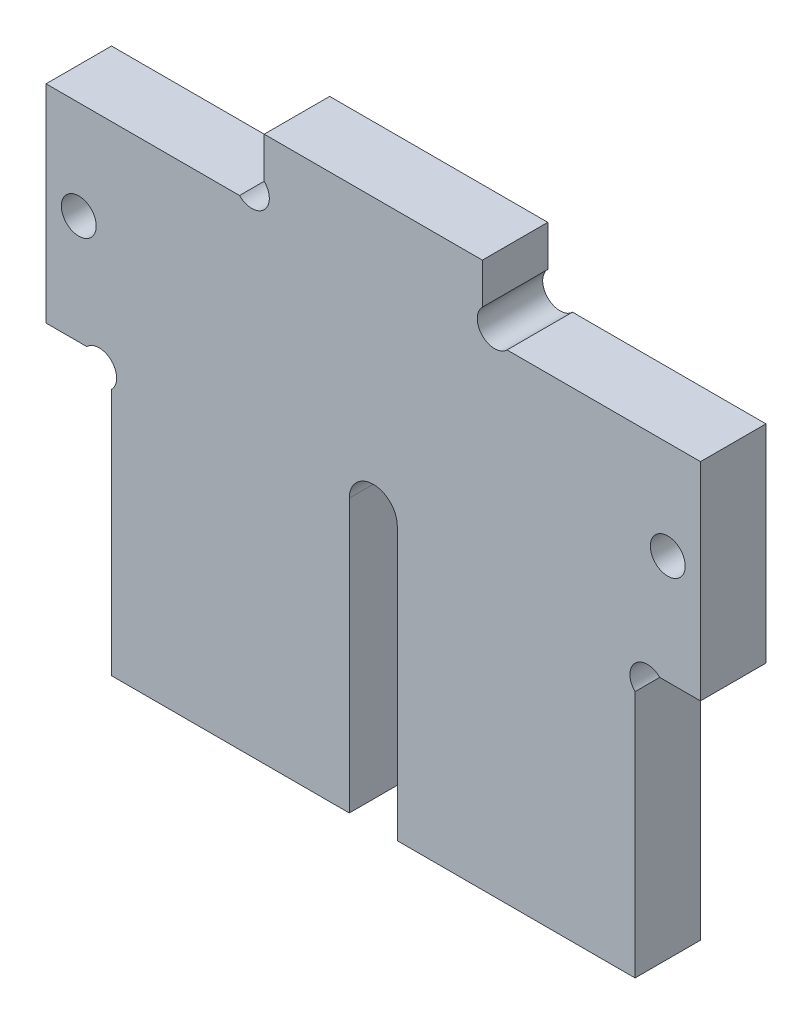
from build123d import *

# Parameters (mm, degrees)
ESQUISSE1_R        = 1.6
BOSS_EXTRU_1_DEPTH = 6


with BuildPart() as part:
    # Esquisse1 → Boss.-Extru.1 (new body)
    with BuildSketch(Plane.XY):
        with BuildLine():
            Line((10, 46.2627417), (10, 50))
            Line((10, 50), (-10, 50))
            Line((-10, 50), (-10, 46.2627417))
            ThreePointArc((-10, 46.2627417), (-10, 44), (-12.2627417, 44))
            Line((-12.2627417, 44), (-30, 44))
            Line((-30, 44), (-30, 25))
            Line((-30, 25), (-26.2627417, 25))
            ThreePointArc((-26.2627417, 25), (-24, 25), (-24, 22.7372583))
            Line((-24, 22.7372583), (-24, 0))
            Line((-24, 0), (-2.2, 0))
            Line((-2.2, 0), (-2.2, 25))
            ThreePointArc((-2.2, 25), (0, 27.2), (2.2, 25))
            Line((2.2, 25), (2.2, 0))
            Line((2.2, 0), (24, 0))
            Line((24, 0), (24, 22.7372583))
            ThreePointArc((24, 22.7372583), (24, 25), (26.2627417, 25))
            Line((26.2627417, 25), (30, 25))
            Line((30, 25), (30, 44))
            Line((30, 44), (12.2627417, 44))
            ThreePointArc((12.2627417, 44), (10, 44), (10, 46.2627417))
        make_face()
        with Locations((27, 35)):
            Circle(ESQUISSE1_R, mode=Mode.SUBTRACT)
        with Locations(Location((-27, 35, 0), (0, 0, 180))):
            Circle(ESQUISSE1_R, mode=Mode.SUBTRACT)
    extrude(amount=BOSS_EXTRU_1_DEPTH)


solid = part.part
